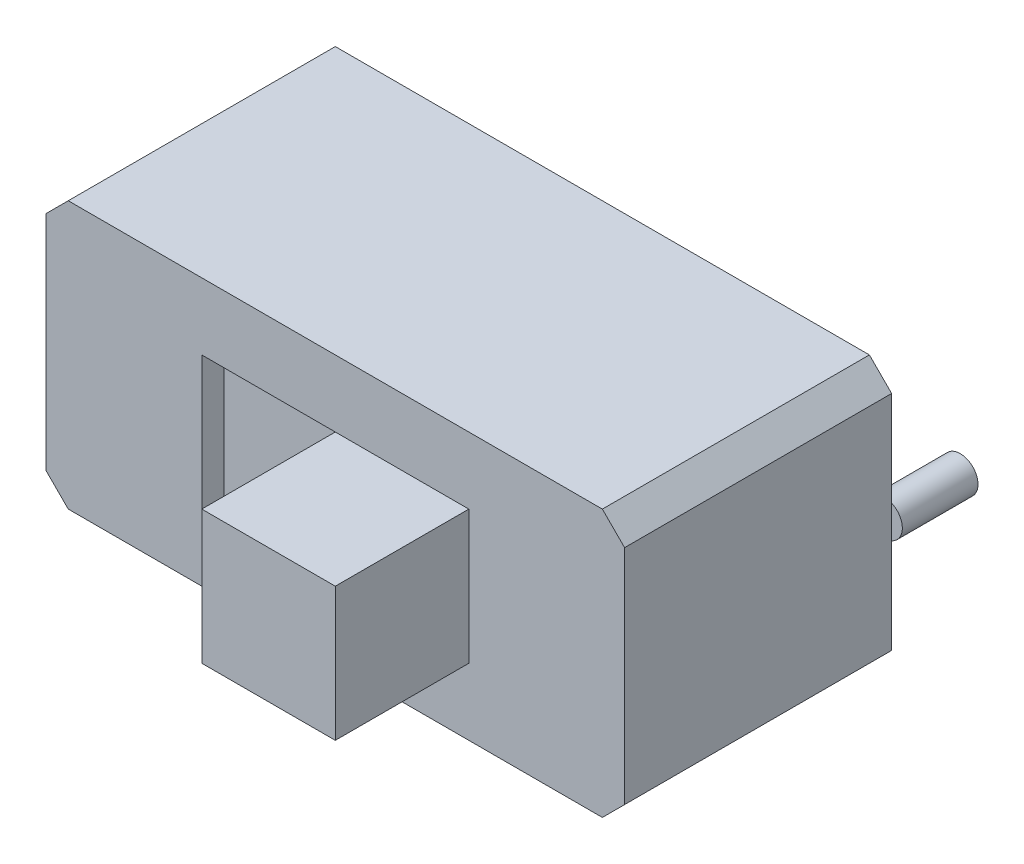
from build123d import *

# Parameters (mm, degrees)
EXTRUSION1_DEPTH        = 6
ESQUISSE2_W             = 3
ESQUISSE2_H             = 3
EXTRUSION2_DEPTH        = 3
ESQUISSE3_W             = 3
ESQUISSE3_H             = 3
ENL_V_MAT_EXTRU_1_DEPTH = 0.5
ESQUISSE4_R             = 0.4
BOSS_EXTRU_1_DEPTH      = 1.7


with BuildPart() as part:
    # Esquisse1 → Extrusion1 (new body)
    with BuildSketch(Plane.XY):
        Polygon((6.5, -2.5), (6.5, 2.5), (6, 3), (-6, 3), (-6.5, 2.5), (-6.5, -2.5), (-6, -3), (6, -3), align=None)
    extrude(amount=EXTRUSION1_DEPTH)

    # Esquisse2 → Extrusion2 (add)
    with BuildSketch(Plane.XY.offset(6)):
        with Locations((1.5, 0)):
            Rectangle(ESQUISSE2_W, ESQUISSE2_H)
    extrude(amount=EXTRUSION2_DEPTH)

    # Esquisse3 → Enl_v. mat.-Extru.1 (cut)
    with BuildSketch(Plane.XY.offset(6)):
        with Locations((-1.5, 0)):
            Rectangle(ESQUISSE3_W, ESQUISSE3_H)
    extrude(amount=-ENL_V_MAT_EXTRU_1_DEPTH, mode=Mode.SUBTRACT)

    # Esquisse4 → Boss.-Extru.1 (add)
    with BuildSketch(Plane(origin=(0, 0, 0), x_dir=(-1, 0, 0), z_dir=(0, 0, -1))):
        Circle(ESQUISSE4_R)
        with Locations((3.17, 0)):
            Circle(ESQUISSE4_R)
        with Locations(Location((6.34, 0, 0), (0, 0, 293.578178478))):
            Circle(ESQUISSE4_R)
        with Locations(Location((-3.17, 0, 0), (0, 0, 180))):
            Circle(ESQUISSE4_R)
        with Locations(Location((-6.34, 0, 0), (0, 0, 180))):
            Circle(ESQUISSE4_R)
    extrude(amount=BOSS_EXTRU_1_DEPTH)


solid = part.part
